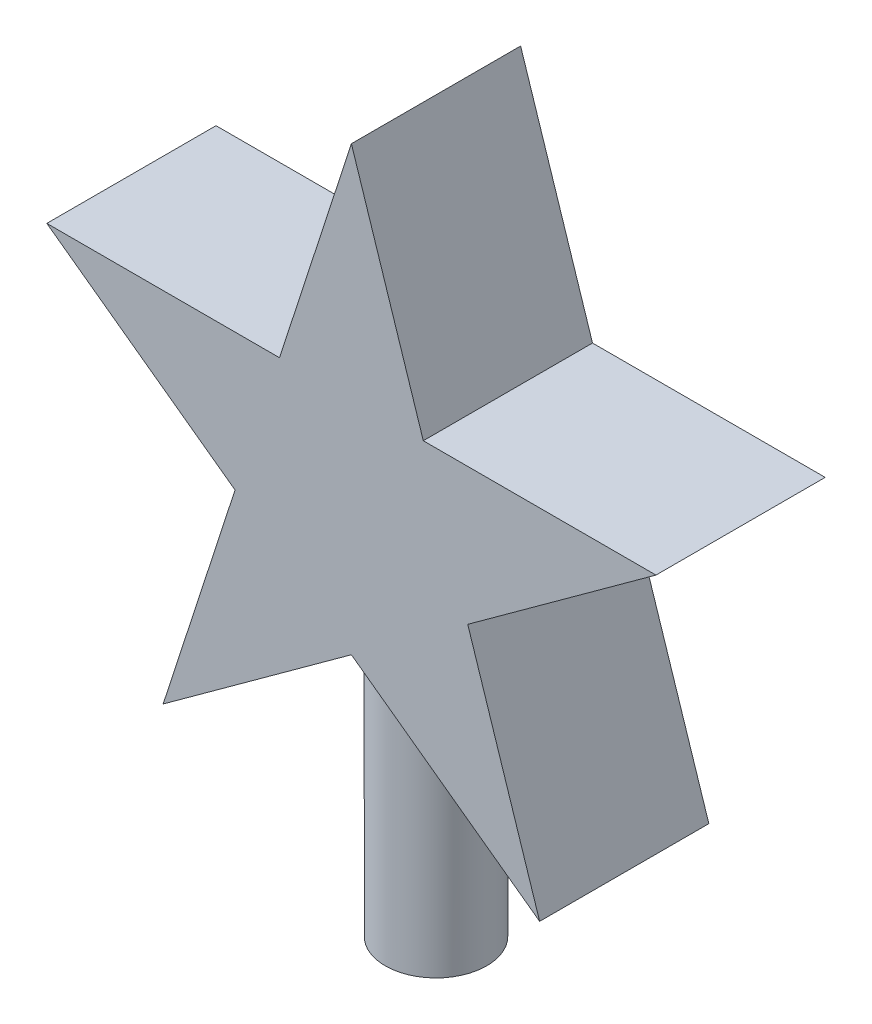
from build123d import *

# Parameters (mm, degrees)
EXTRUDE_9_DEPTH  = 5
SKETCH_9_R       = 1.5
EXTRUDE_10_DEPTH = 15


with BuildPart() as part:
    # Sketch 1 → Extrude 9 (new body)
    with BuildSketch(Plane.XY):
        Polygon((-9, 2.924277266), (-2.124611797, 2.924277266), (0, 9.463160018), (2.124611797, 2.924277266), (9, 2.924277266), (3.437694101, -1.116974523), (5.562305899, -7.655857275), (0, -3.614605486), (-5.562305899, -7.655857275), (-3.437694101, -1.116974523), align=None)
    extrude(amount=EXTRUDE_9_DEPTH)

    # Sketch 9 → Extrude 10 (add)
    with BuildSketch(Plane(origin=(0, 2.924277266, 0), x_dir=(1, 0, 0), z_dir=(0, 1, 0))):
        with Locations(Location((0, -2.5, 0), (0, 0, 180))):
            Circle(SKETCH_9_R)
    extrude(amount=-EXTRUDE_10_DEPTH)


solid = part.part
